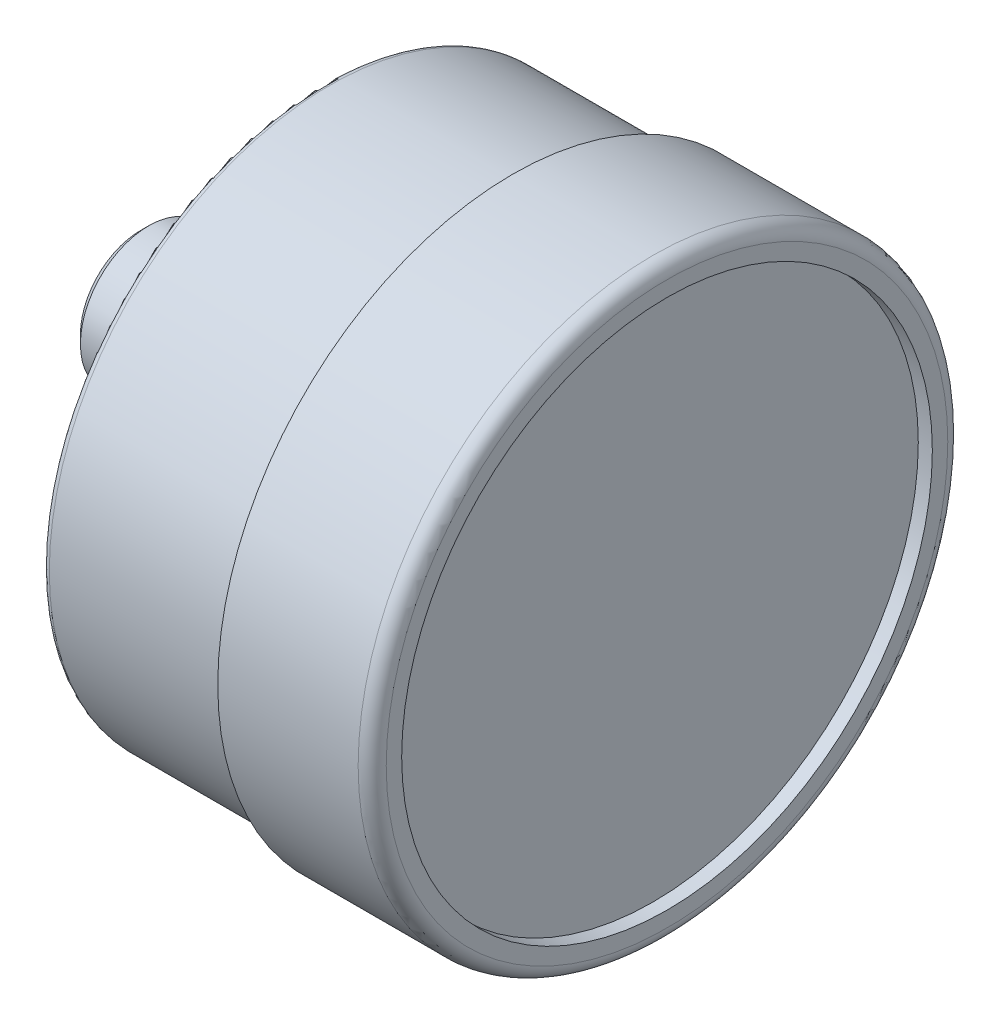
from build123d import *

# Parameters (mm, degrees)
SKETCH_3_R          = 20
SKETCH_3_W          = 9.728
SKETCH_3_H          = 9.728
CUT_EXTRUDE_1_DEPTH = 18.75


with BuildPart() as part:
    # Sketch 1 → Revolve 1 (revolve)
    with BuildSketch(Plane.XY, mode=Mode.PRIVATE) as revolve_1_sk:
        with BuildLine():
            Line((-13, 0), (-13, 4.283))
            Line((-13, 4.283), (-12.419, 4.864))
            Line((-12.419, 4.864), (0, 4.864))
            Line((0, 4.864), (0, 19.5))
            ThreePointArc((0, 19.5), (0.146446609, 19.853553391), (0.5, 20))
            Line((0.5, 20), (13.5, 20))
            Line((13.5, 20), (13.5, 21))
            Line((13.5, 21), (23.5, 21))
            ThreePointArc((23.5, 21), (24.207106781, 20.707106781), (24.5, 20))
            Line((24.5, 20), (24.5, 18.9))
            Line((24.5, 18.9), (23.5, 18.9))
            Line((23.5, 18.9), (23.5, 0))
            Line((23.5, 0), (-13, 0))
        make_face()
    revolve(revolve_1_sk.sketch.rotate(Axis((23.5, 0, 0), (-1, 0, 0)), 270), axis=Axis((23.5, 0, 0), (-1, 0, 0)))

    # Sketch 2 → Revolve 2 (revolve)
    with BuildSketch(Plane.XY, mode=Mode.PRIVATE) as revolve_2_sk:
        with BuildLine():
            Line((-6.5, 0), (-6.5, 4.864))
            ThreePointArc((-6.5, 4.864), (-5.053797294, 7.415467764), (-3.25, 9.728))
            Line((-3.25, 9.728), (0, 9.728))
            Line((0, 9.728), (0, 0))
            Line((0, 0), (-6.5, 0))
        make_face()
    revolve(revolve_2_sk.sketch.rotate(Axis((0, 0, 0), (-1, 0, 0)), 90), axis=Axis((0, 0, 0), (-1, 0, 0)))

    # Sketch 3 → Cut-Extrude 1 (cut)
    with BuildSketch(Plane(origin=(0, 0, 0), x_dir=(0, 0, -1), z_dir=(1, 0, 0))):
        with Locations(Location((0, 0, 0), (0, 0, 180))):
            Circle(SKETCH_3_R)
        Rectangle(SKETCH_3_W, SKETCH_3_H, mode=Mode.SUBTRACT)
    extrude(amount=-CUT_EXTRUDE_1_DEPTH, mode=Mode.SUBTRACT)


solid = part.part
